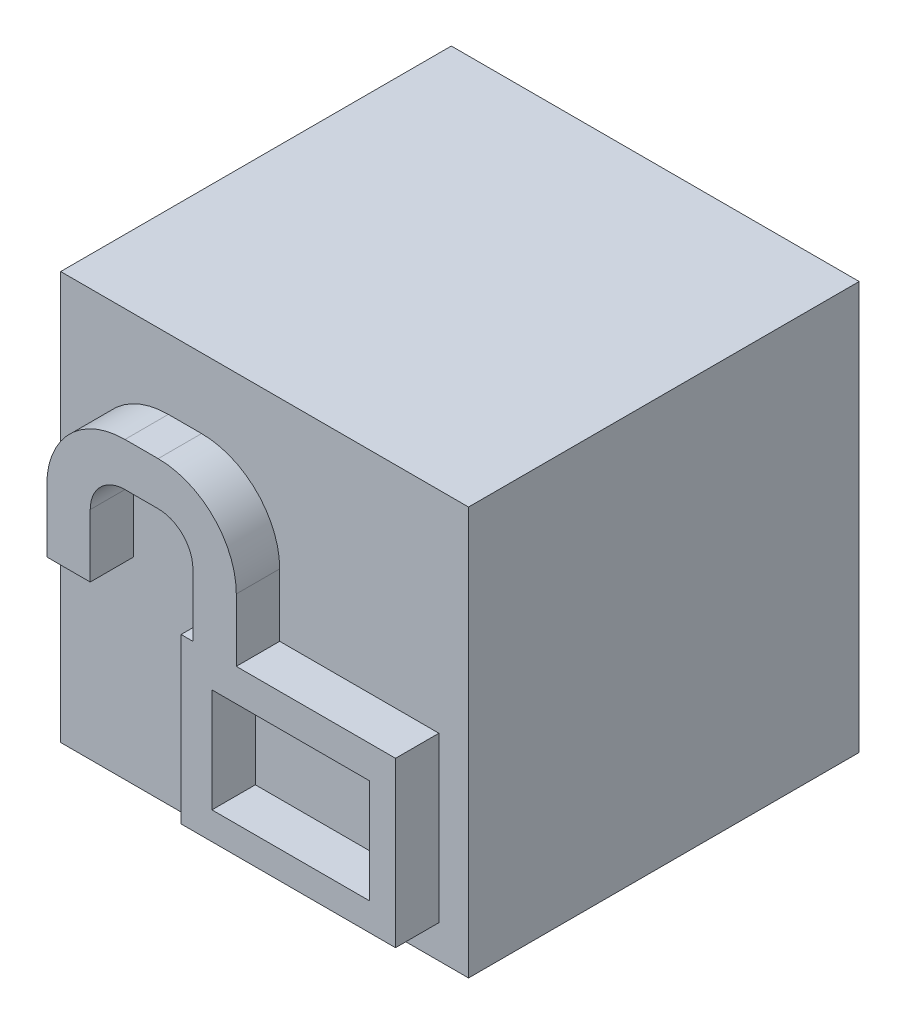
ISO-10303-21;
HEADER;
FILE_DESCRIPTION(('STEP AP214'),'2;1');
FILE_NAME('part.step','',(''),(''),'','','');
FILE_SCHEMA(('AUTOMOTIVE_DESIGN { 1 0 10303 214 1 1 1 1 }'));
ENDSEC;
DATA;
#1=APPLICATION_CONTEXT('core data for automotive mechanical design processes');
#2=APPLICATION_PROTOCOL_DEFINITION('international standard','automotive_design',2000,#1);
#3=PRODUCT_CONTEXT('',#1,'mechanical');
#4=PRODUCT('Part','Part','',(#3));
#5=PRODUCT_RELATED_PRODUCT_CATEGORY('part','',(#4));
#6=PRODUCT_DEFINITION_FORMATION('','',#4);
#7=PRODUCT_DEFINITION_CONTEXT('part definition',#1,'design');
#8=PRODUCT_DEFINITION('design','',#6,#7);
#9=PRODUCT_DEFINITION_SHAPE('','',#8);
#10=(LENGTH_UNIT() NAMED_UNIT(*) SI_UNIT(.MILLI.,.METRE.));
#11=(NAMED_UNIT(*) PLANE_ANGLE_UNIT() SI_UNIT($,.RADIAN.));
#12=(NAMED_UNIT(*) SI_UNIT($,.STERADIAN.) SOLID_ANGLE_UNIT());
#13=UNCERTAINTY_MEASURE_WITH_UNIT(LENGTH_MEASURE(1.E-05),#10,'distance_accuracy_value','');
#14=(GEOMETRIC_REPRESENTATION_CONTEXT(3) GLOBAL_UNCERTAINTY_ASSIGNED_CONTEXT((#13)) GLOBAL_UNIT_ASSIGNED_CONTEXT((#10,
#11,#12)) REPRESENTATION_CONTEXT('',''));
#15=CARTESIAN_POINT('',(0.,0.,0.));
#16=DIRECTION('',(0.,0.,1.));
#17=DIRECTION('',(1.,0.,0.));
#18=AXIS2_PLACEMENT_3D('',#15,#16,#17);
#19=CARTESIAN_POINT('',(0.,0.,-0.300000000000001));
#20=DIRECTION('',(0.,0.,-1.));
#21=DIRECTION('',(-1.,0.,0.));
#22=AXIS2_PLACEMENT_3D('',#19,#20,#21);
#23=PLANE('',#22);
#24=DIRECTION('',(-1.,0.,0.));
#25=VECTOR('',#24,1.);
#26=CARTESIAN_POINT('',(0.30139237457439,25.5354081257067,-0.300000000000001));
#27=LINE('',#26,#25);
#28=CARTESIAN_POINT('',(5.,25.5354081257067,-0.300000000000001));
#29=VERTEX_POINT('',#28);
#30=CARTESIAN_POINT('',(0.30139237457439,25.5354081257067,-0.300000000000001));
#31=VERTEX_POINT('',#30);
#32=EDGE_CURVE('E358',#29,#31,#27,.T.);
#33=ORIENTED_EDGE('',*,*,#32,.T.);
#34=DIRECTION('',(0.,-1.,0.));
#35=VECTOR('',#34,1.);
#36=CARTESIAN_POINT('',(0.30139237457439,25.5354081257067,-0.300000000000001));
#37=LINE('',#36,#35);
#38=CARTESIAN_POINT('',(0.301392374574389,20.836800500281,-0.300000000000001));
#39=VERTEX_POINT('',#38);
#40=EDGE_CURVE('E361',#31,#39,#37,.T.);
#41=ORIENTED_EDGE('',*,*,#40,.T.);
#42=DIRECTION('',(1.,0.,0.));
#43=VECTOR('',#42,1.);
#44=CARTESIAN_POINT('',(0.301392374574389,20.836800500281,-0.300000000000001));
#45=LINE('',#44,#43);
#46=CARTESIAN_POINT('',(5.,20.836800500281,-0.300000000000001));
#47=VERTEX_POINT('',#46);
#48=EDGE_CURVE('E364',#39,#47,#45,.T.);
#49=ORIENTED_EDGE('',*,*,#48,.T.);
#50=DIRECTION('',(0.,1.,0.));
#51=VECTOR('',#50,1.);
#52=CARTESIAN_POINT('',(5.,25.5354081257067,-0.300000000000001));
#53=LINE('',#52,#51);
#54=EDGE_CURVE('E366',#47,#29,#53,.T.);
#55=ORIENTED_EDGE('',*,*,#54,.T.);
#56=EDGE_LOOP('',(#33,#41,#49,#55));
#57=FACE_BOUND('',#56,.T.);
#58=DIRECTION('',(0.,1.,0.));
#59=VECTOR('',#58,1.);
#60=CARTESIAN_POINT('',(4.65854749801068,21.218065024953,-0.300000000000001));
#61=LINE('',#60,#59);
#62=CARTESIAN_POINT('',(4.65854749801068,21.218065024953,-0.300000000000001));
#63=VERTEX_POINT('',#62);
#64=CARTESIAN_POINT('',(4.65854749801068,23.1079682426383,-0.300000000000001));
#65=VERTEX_POINT('',#64);
#66=EDGE_CURVE('E210',#63,#65,#61,.T.);
#67=ORIENTED_EDGE('',*,*,#66,.F.);
#68=DIRECTION('',(1.,0.,0.));
#69=VECTOR('',#68,1.);
#70=CARTESIAN_POINT('',(4.65854749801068,21.218065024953,-0.300000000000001));
#71=LINE('',#70,#69);
#72=CARTESIAN_POINT('',(2.18857497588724,21.218065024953,-0.300000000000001));
#73=VERTEX_POINT('',#72);
#74=EDGE_CURVE('E238',#73,#63,#71,.T.);
#75=ORIENTED_EDGE('',*,*,#74,.F.);
#76=DIRECTION('',(0.,-1.,0.));
#77=VECTOR('',#76,1.);
#78=CARTESIAN_POINT('',(2.18857497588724,21.218065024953,-0.300000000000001));
#79=LINE('',#78,#77);
#80=CARTESIAN_POINT('',(2.18857497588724,23.1079682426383,-0.300000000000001));
#81=VERTEX_POINT('',#80);
#82=EDGE_CURVE('E306',#81,#73,#79,.T.);
#83=ORIENTED_EDGE('',*,*,#82,.F.);
#84=DIRECTION('',(-1.,0.,0.));
#85=VECTOR('',#84,1.);
#86=CARTESIAN_POINT('',(2.32454156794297,23.1079682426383,-0.300000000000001));
#87=LINE('',#86,#85);
#88=CARTESIAN_POINT('',(2.32454156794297,23.1079682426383,-0.300000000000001));
#89=VERTEX_POINT('',#88);
#90=EDGE_CURVE('E303',#89,#81,#87,.T.);
#91=ORIENTED_EDGE('',*,*,#90,.F.);
#92=DIRECTION('',(0.,-1.,0.));
#93=VECTOR('',#92,1.);
#94=CARTESIAN_POINT('',(2.32454156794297,23.1079682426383,-0.300000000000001));
#95=LINE('',#94,#93);
#96=CARTESIAN_POINT('',(2.32454156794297,23.830650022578,-0.300000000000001));
#97=VERTEX_POINT('',#96);
#98=EDGE_CURVE('E300',#97,#89,#95,.T.);
#99=ORIENTED_EDGE('',*,*,#98,.F.);
#100=CARTESIAN_POINT('',(1.92454156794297,23.830650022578,-0.300000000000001));
#101=DIRECTION('',(0.,0.,-1.));
#102=DIRECTION('',(1.,0.,0.));
#103=AXIS2_PLACEMENT_3D('',#100,#101,#102);
#104=CIRCLE('',#103,0.4);
#105=CARTESIAN_POINT('',(1.92454156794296,24.230650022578,-0.300000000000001));
#106=VERTEX_POINT('',#105);
#107=EDGE_CURVE('E297',#106,#97,#104,.T.);
#108=ORIENTED_EDGE('',*,*,#107,.F.);
#109=DIRECTION('',(1.,0.,0.));
#110=VECTOR('',#109,1.);
#111=CARTESIAN_POINT('',(1.92454156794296,24.230650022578,-0.300000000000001));
#112=LINE('',#111,#110);
#113=CARTESIAN_POINT('',(1.54189892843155,24.230650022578,-0.300000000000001));
#114=VERTEX_POINT('',#113);
#115=EDGE_CURVE('E294',#114,#106,#112,.T.);
#116=ORIENTED_EDGE('',*,*,#115,.F.);
#117=CARTESIAN_POINT('',(1.54189892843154,23.830650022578,-0.300000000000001));
#118=DIRECTION('',(0.,0.,-1.));
#119=DIRECTION('',(1.,0.,0.));
#120=AXIS2_PLACEMENT_3D('',#117,#118,#119);
#121=CIRCLE('',#120,0.400000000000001);
#122=CARTESIAN_POINT('',(1.14189892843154,23.830650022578,-0.300000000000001));
#123=VERTEX_POINT('',#122);
#124=EDGE_CURVE('E291',#123,#114,#121,.T.);
#125=ORIENTED_EDGE('',*,*,#124,.F.);
#126=DIRECTION('',(0.,1.,0.));
#127=VECTOR('',#126,1.);
#128=CARTESIAN_POINT('',(1.14189892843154,23.1079682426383,-0.300000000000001));
#129=LINE('',#128,#127);
#130=CARTESIAN_POINT('',(1.14189892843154,23.1079682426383,-0.300000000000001));
#131=VERTEX_POINT('',#130);
#132=EDGE_CURVE('E288',#131,#123,#129,.T.);
#133=ORIENTED_EDGE('',*,*,#132,.F.);
#134=DIRECTION('',(1.,0.,0.));
#135=VECTOR('',#134,1.);
#136=CARTESIAN_POINT('',(1.14189892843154,23.1079682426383,-0.300000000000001));
#137=LINE('',#136,#135);
#138=CARTESIAN_POINT('',(0.641898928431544,23.1079682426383,-0.300000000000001));
#139=VERTEX_POINT('',#138);
#140=EDGE_CURVE('E285',#139,#131,#137,.T.);
#141=ORIENTED_EDGE('',*,*,#140,.F.);
#142=DIRECTION('',(0.,-1.,0.));
#143=VECTOR('',#142,1.);
#144=CARTESIAN_POINT('',(0.641898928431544,23.1079682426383,-0.300000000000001));
#145=LINE('',#144,#143);
#146=CARTESIAN_POINT('',(0.641898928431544,23.830650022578,-0.300000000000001));
#147=VERTEX_POINT('',#146);
#148=EDGE_CURVE('E282',#147,#139,#145,.T.);
#149=ORIENTED_EDGE('',*,*,#148,.F.);
#150=CARTESIAN_POINT('',(1.54189892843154,23.830650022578,-0.300000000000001));
#151=DIRECTION('',(0.,0.,1.));
#152=DIRECTION('',(1.,0.,0.));
#153=AXIS2_PLACEMENT_3D('',#150,#151,#152);
#154=CIRCLE('',#153,0.900000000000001);
#155=CARTESIAN_POINT('',(1.54189892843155,24.730650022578,-0.300000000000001));
#156=VERTEX_POINT('',#155);
#157=EDGE_CURVE('E279',#156,#147,#154,.T.);
#158=ORIENTED_EDGE('',*,*,#157,.F.);
#159=DIRECTION('',(-1.,0.,0.));
#160=VECTOR('',#159,1.);
#161=CARTESIAN_POINT('',(1.92454156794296,24.730650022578,-0.300000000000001));
#162=LINE('',#161,#160);
#163=CARTESIAN_POINT('',(1.92454156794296,24.730650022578,-0.300000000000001));
#164=VERTEX_POINT('',#163);
#165=EDGE_CURVE('E276',#164,#156,#162,.T.);
#166=ORIENTED_EDGE('',*,*,#165,.F.);
#167=CARTESIAN_POINT('',(1.92454156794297,23.830650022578,-0.300000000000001));
#168=DIRECTION('',(0.,0.,1.));
#169=DIRECTION('',(1.,0.,0.));
#170=AXIS2_PLACEMENT_3D('',#167,#168,#169);
#171=CIRCLE('',#170,0.900000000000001);
#172=CARTESIAN_POINT('',(2.82454156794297,23.830650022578,-0.300000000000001));
#173=VERTEX_POINT('',#172);
#174=EDGE_CURVE('E273',#173,#164,#171,.T.);
#175=ORIENTED_EDGE('',*,*,#174,.F.);
#176=DIRECTION('',(0.,1.,0.));
#177=VECTOR('',#176,1.);
#178=CARTESIAN_POINT('',(2.82454156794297,23.1079682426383,-0.300000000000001));
#179=LINE('',#178,#177);
#180=CARTESIAN_POINT('',(2.82454156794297,23.1079682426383,-0.300000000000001));
#181=VERTEX_POINT('',#180);
#182=EDGE_CURVE('E52',#181,#173,#179,.T.);
#183=ORIENTED_EDGE('',*,*,#182,.F.);
#184=DIRECTION('',(-1.,0.,0.));
#185=VECTOR('',#184,1.);
#186=CARTESIAN_POINT('',(4.65854749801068,23.1079682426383,-0.300000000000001));
#187=LINE('',#186,#185);
#188=EDGE_CURVE('E47',#65,#181,#187,.T.);
#189=ORIENTED_EDGE('',*,*,#188,.F.);
#190=EDGE_LOOP('',(#67,#75,#83,#91,#99,#108,#116,#125,#133,#141,#149,#158,#166,#175,#183,#189));
#191=FACE_BOUND('',#190,.T.);
#192=ADVANCED_FACE('F32',(#57,#191),#23,.F.);
#193=CARTESIAN_POINT('',(0.30139237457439,25.5354081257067,-0.300000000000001));
#194=DIRECTION('',(0.,-1.,0.));
#195=DIRECTION('',(0.,0.,-1.));
#196=AXIS2_PLACEMENT_3D('',#193,#194,#195);
#197=PLANE('',#196);
#198=DIRECTION('',(-1.,0.,0.));
#199=VECTOR('',#198,1.);
#200=CARTESIAN_POINT('',(0.30139237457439,25.5354081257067,-4.8));
#201=LINE('',#200,#199);
#202=CARTESIAN_POINT('',(5.,25.5354081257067,-4.8));
#203=VERTEX_POINT('',#202);
#204=CARTESIAN_POINT('',(0.30139237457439,25.5354081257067,-4.8));
#205=VERTEX_POINT('',#204);
#206=EDGE_CURVE('E357',#203,#205,#201,.T.);
#207=ORIENTED_EDGE('',*,*,#206,.T.);
#208=DIRECTION('',(0.,0.,-1.));
#209=VECTOR('',#208,1.);
#210=CARTESIAN_POINT('',(0.30139237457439,25.5354081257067,-0.300000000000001));
#211=LINE('',#210,#209);
#212=EDGE_CURVE('E11',#31,#205,#211,.T.);
#213=ORIENTED_EDGE('',*,*,#212,.F.);
#214=ORIENTED_EDGE('',*,*,#32,.F.);
#215=DIRECTION('',(0.,0.,-1.));
#216=VECTOR('',#215,1.);
#217=CARTESIAN_POINT('',(5.,25.5354081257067,-0.300000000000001));
#218=LINE('',#217,#216);
#219=EDGE_CURVE('E368',#29,#203,#218,.T.);
#220=ORIENTED_EDGE('',*,*,#219,.T.);
#221=EDGE_LOOP('',(#207,#213,#214,#220));
#222=FACE_BOUND('',#221,.T.);
#223=ADVANCED_FACE('F34',(#222),#197,.F.);
#224=CARTESIAN_POINT('',(0.30139237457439,25.5354081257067,-0.300000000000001));
#225=DIRECTION('',(1.,0.,0.));
#226=DIRECTION('',(0.,1.,0.));
#227=AXIS2_PLACEMENT_3D('',#224,#225,#226);
#228=PLANE('',#227);
#229=DIRECTION('',(0.,-1.,0.));
#230=VECTOR('',#229,1.);
#231=CARTESIAN_POINT('',(0.30139237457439,25.5354081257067,-4.8));
#232=LINE('',#231,#230);
#233=CARTESIAN_POINT('',(0.301392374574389,20.836800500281,-4.8));
#234=VERTEX_POINT('',#233);
#235=EDGE_CURVE('E371',#205,#234,#232,.T.);
#236=ORIENTED_EDGE('',*,*,#235,.T.);
#237=DIRECTION('',(0.,0.,-1.));
#238=VECTOR('',#237,1.);
#239=CARTESIAN_POINT('',(0.301392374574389,20.836800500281,-0.300000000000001));
#240=LINE('',#239,#238);
#241=EDGE_CURVE('E40',#39,#234,#240,.T.);
#242=ORIENTED_EDGE('',*,*,#241,.F.);
#243=ORIENTED_EDGE('',*,*,#40,.F.);
#244=ORIENTED_EDGE('',*,*,#212,.T.);
#245=EDGE_LOOP('',(#236,#242,#243,#244));
#246=FACE_BOUND('',#245,.T.);
#247=ADVANCED_FACE('F400',(#246),#228,.F.);
#248=CARTESIAN_POINT('',(0.301392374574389,20.836800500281,-0.300000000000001));
#249=DIRECTION('',(0.,1.,0.));
#250=DIRECTION('',(0.,0.,1.));
#251=AXIS2_PLACEMENT_3D('',#248,#249,#250);
#252=PLANE('',#251);
#253=DIRECTION('',(1.,0.,0.));
#254=VECTOR('',#253,1.);
#255=CARTESIAN_POINT('',(0.301392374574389,20.836800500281,-4.8));
#256=LINE('',#255,#254);
#257=CARTESIAN_POINT('',(5.,20.836800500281,-4.8));
#258=VERTEX_POINT('',#257);
#259=EDGE_CURVE('E373',#234,#258,#256,.T.);
#260=ORIENTED_EDGE('',*,*,#259,.T.);
#261=DIRECTION('',(0.,0.,-1.));
#262=VECTOR('',#261,1.);
#263=CARTESIAN_POINT('',(5.,20.836800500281,-0.300000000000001));
#264=LINE('',#263,#262);
#265=EDGE_CURVE('E378',#47,#258,#264,.T.);
#266=ORIENTED_EDGE('',*,*,#265,.F.);
#267=ORIENTED_EDGE('',*,*,#48,.F.);
#268=ORIENTED_EDGE('',*,*,#241,.T.);
#269=EDGE_LOOP('',(#260,#266,#267,#268));
#270=FACE_BOUND('',#269,.T.);
#271=ADVANCED_FACE('F385',(#270),#252,.F.);
#272=CARTESIAN_POINT('',(5.,25.5354081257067,-0.300000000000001));
#273=DIRECTION('',(-1.,0.,0.));
#274=DIRECTION('',(0.,-1.,0.));
#275=AXIS2_PLACEMENT_3D('',#272,#273,#274);
#276=PLANE('',#275);
#277=DIRECTION('',(0.,1.,0.));
#278=VECTOR('',#277,1.);
#279=CARTESIAN_POINT('',(5.,25.5354081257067,-4.8));
#280=LINE('',#279,#278);
#281=EDGE_CURVE('E362',#258,#203,#280,.T.);
#282=ORIENTED_EDGE('',*,*,#281,.T.);
#283=ORIENTED_EDGE('',*,*,#219,.F.);
#284=ORIENTED_EDGE('',*,*,#54,.F.);
#285=ORIENTED_EDGE('',*,*,#265,.T.);
#286=EDGE_LOOP('',(#282,#283,#284,#285));
#287=FACE_BOUND('',#286,.T.);
#288=ADVANCED_FACE('F394',(#287),#276,.F.);
#289=CARTESIAN_POINT('',(0.,0.,-4.8));
#290=DIRECTION('',(0.,0.,-1.));
#291=DIRECTION('',(-1.,0.,0.));
#292=AXIS2_PLACEMENT_3D('',#289,#290,#291);
#293=PLANE('',#292);
#294=ORIENTED_EDGE('',*,*,#206,.F.);
#295=ORIENTED_EDGE('',*,*,#281,.F.);
#296=ORIENTED_EDGE('',*,*,#259,.F.);
#297=ORIENTED_EDGE('',*,*,#235,.F.);
#298=EDGE_LOOP('',(#294,#295,#296,#297));
#299=FACE_BOUND('',#298,.T.);
#300=ADVANCED_FACE('F391',(#299),#293,.T.);
#301=CARTESIAN_POINT('',(1.92454156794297,23.830650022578,0.199999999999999));
#302=DIRECTION('',(0.,0.,1.));
#303=DIRECTION('',(1.,0.,0.));
#304=AXIS2_PLACEMENT_3D('',#301,#302,#303);
#305=PLANE('',#304);
#306=DIRECTION('',(0.,1.,0.));
#307=VECTOR('',#306,1.);
#308=CARTESIAN_POINT('',(4.65854749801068,21.218065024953,0.199999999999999));
#309=LINE('',#308,#307);
#310=CARTESIAN_POINT('',(4.65854749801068,21.218065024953,0.199999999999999));
#311=VERTEX_POINT('',#310);
#312=CARTESIAN_POINT('',(4.65854749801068,23.1079682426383,0.199999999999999));
#313=VERTEX_POINT('',#312);
#314=EDGE_CURVE('E234',#311,#313,#309,.T.);
#315=ORIENTED_EDGE('',*,*,#314,.T.);
#316=DIRECTION('',(-1.,0.,0.));
#317=VECTOR('',#316,1.);
#318=CARTESIAN_POINT('',(4.65854749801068,23.1079682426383,0.199999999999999));
#319=LINE('',#318,#317);
#320=CARTESIAN_POINT('',(2.82454156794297,23.1079682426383,0.199999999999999));
#321=VERTEX_POINT('',#320);
#322=EDGE_CURVE('E237',#313,#321,#319,.T.);
#323=ORIENTED_EDGE('',*,*,#322,.T.);
#324=DIRECTION('',(0.,1.,0.));
#325=VECTOR('',#324,1.);
#326=CARTESIAN_POINT('',(2.82454156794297,23.1079682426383,0.199999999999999));
#327=LINE('',#326,#325);
#328=CARTESIAN_POINT('',(2.82454156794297,23.830650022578,0.199999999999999));
#329=VERTEX_POINT('',#328);
#330=EDGE_CURVE('E240',#321,#329,#327,.T.);
#331=ORIENTED_EDGE('',*,*,#330,.T.);
#332=CARTESIAN_POINT('',(1.92454156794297,23.830650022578,0.199999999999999));
#333=DIRECTION('',(0.,0.,1.));
#334=DIRECTION('',(1.,0.,0.));
#335=AXIS2_PLACEMENT_3D('',#332,#333,#334);
#336=CIRCLE('',#335,0.900000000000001);
#337=CARTESIAN_POINT('',(1.92454156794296,24.730650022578,0.199999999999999));
#338=VERTEX_POINT('',#337);
#339=EDGE_CURVE('E242',#329,#338,#336,.T.);
#340=ORIENTED_EDGE('',*,*,#339,.T.);
#341=DIRECTION('',(-1.,0.,0.));
#342=VECTOR('',#341,1.);
#343=CARTESIAN_POINT('',(1.92454156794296,24.730650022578,0.199999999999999));
#344=LINE('',#343,#342);
#345=CARTESIAN_POINT('',(1.54189892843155,24.730650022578,0.199999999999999));
#346=VERTEX_POINT('',#345);
#347=EDGE_CURVE('E244',#338,#346,#344,.T.);
#348=ORIENTED_EDGE('',*,*,#347,.T.);
#349=CARTESIAN_POINT('',(1.54189892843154,23.830650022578,0.199999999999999));
#350=DIRECTION('',(0.,0.,1.));
#351=DIRECTION('',(1.,0.,0.));
#352=AXIS2_PLACEMENT_3D('',#349,#350,#351);
#353=CIRCLE('',#352,0.900000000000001);
#354=CARTESIAN_POINT('',(0.641898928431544,23.830650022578,0.199999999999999));
#355=VERTEX_POINT('',#354);
#356=EDGE_CURVE('E246',#346,#355,#353,.T.);
#357=ORIENTED_EDGE('',*,*,#356,.T.);
#358=DIRECTION('',(0.,-1.,0.));
#359=VECTOR('',#358,1.);
#360=CARTESIAN_POINT('',(0.641898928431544,23.1079682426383,0.199999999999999));
#361=LINE('',#360,#359);
#362=CARTESIAN_POINT('',(0.641898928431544,23.1079682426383,0.199999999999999));
#363=VERTEX_POINT('',#362);
#364=EDGE_CURVE('E248',#355,#363,#361,.T.);
#365=ORIENTED_EDGE('',*,*,#364,.T.);
#366=DIRECTION('',(1.,0.,0.));
#367=VECTOR('',#366,1.);
#368=CARTESIAN_POINT('',(1.14189892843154,23.1079682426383,0.199999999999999));
#369=LINE('',#368,#367);
#370=CARTESIAN_POINT('',(1.14189892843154,23.1079682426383,0.199999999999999));
#371=VERTEX_POINT('',#370);
#372=EDGE_CURVE('E250',#363,#371,#369,.T.);
#373=ORIENTED_EDGE('',*,*,#372,.T.);
#374=DIRECTION('',(0.,1.,0.));
#375=VECTOR('',#374,1.);
#376=CARTESIAN_POINT('',(1.14189892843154,23.1079682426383,0.199999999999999));
#377=LINE('',#376,#375);
#378=CARTESIAN_POINT('',(1.14189892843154,23.830650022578,0.199999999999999));
#379=VERTEX_POINT('',#378);
#380=EDGE_CURVE('E252',#371,#379,#377,.T.);
#381=ORIENTED_EDGE('',*,*,#380,.T.);
#382=CARTESIAN_POINT('',(1.54189892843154,23.830650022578,0.199999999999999));
#383=DIRECTION('',(0.,0.,-1.));
#384=DIRECTION('',(1.,0.,0.));
#385=AXIS2_PLACEMENT_3D('',#382,#383,#384);
#386=CIRCLE('',#385,0.400000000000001);
#387=CARTESIAN_POINT('',(1.54189892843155,24.230650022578,0.199999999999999));
#388=VERTEX_POINT('',#387);
#389=EDGE_CURVE('E254',#379,#388,#386,.T.);
#390=ORIENTED_EDGE('',*,*,#389,.T.);
#391=DIRECTION('',(1.,0.,0.));
#392=VECTOR('',#391,1.);
#393=CARTESIAN_POINT('',(1.92454156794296,24.230650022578,0.199999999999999));
#394=LINE('',#393,#392);
#395=CARTESIAN_POINT('',(1.92454156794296,24.230650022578,0.199999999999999));
#396=VERTEX_POINT('',#395);
#397=EDGE_CURVE('E256',#388,#396,#394,.T.);
#398=ORIENTED_EDGE('',*,*,#397,.T.);
#399=CARTESIAN_POINT('',(1.92454156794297,23.830650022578,0.199999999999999));
#400=DIRECTION('',(0.,0.,-1.));
#401=DIRECTION('',(1.,0.,0.));
#402=AXIS2_PLACEMENT_3D('',#399,#400,#401);
#403=CIRCLE('',#402,0.4);
#404=CARTESIAN_POINT('',(2.32454156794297,23.830650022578,0.199999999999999));
#405=VERTEX_POINT('',#404);
#406=EDGE_CURVE('E258',#396,#405,#403,.T.);
#407=ORIENTED_EDGE('',*,*,#406,.T.);
#408=DIRECTION('',(0.,-1.,0.));
#409=VECTOR('',#408,1.);
#410=CARTESIAN_POINT('',(2.32454156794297,23.1079682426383,0.199999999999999));
#411=LINE('',#410,#409);
#412=CARTESIAN_POINT('',(2.32454156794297,23.1079682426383,0.199999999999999));
#413=VERTEX_POINT('',#412);
#414=EDGE_CURVE('E260',#405,#413,#411,.T.);
#415=ORIENTED_EDGE('',*,*,#414,.T.);
#416=DIRECTION('',(-1.,0.,0.));
#417=VECTOR('',#416,1.);
#418=CARTESIAN_POINT('',(2.32454156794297,23.1079682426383,0.199999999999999));
#419=LINE('',#418,#417);
#420=CARTESIAN_POINT('',(2.18857497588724,23.1079682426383,0.199999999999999));
#421=VERTEX_POINT('',#420);
#422=EDGE_CURVE('E262',#413,#421,#419,.T.);
#423=ORIENTED_EDGE('',*,*,#422,.T.);
#424=DIRECTION('',(0.,-1.,0.));
#425=VECTOR('',#424,1.);
#426=CARTESIAN_POINT('',(2.18857497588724,21.218065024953,0.199999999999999));
#427=LINE('',#426,#425);
#428=CARTESIAN_POINT('',(2.18857497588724,21.218065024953,0.199999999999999));
#429=VERTEX_POINT('',#428);
#430=EDGE_CURVE('E264',#421,#429,#427,.T.);
#431=ORIENTED_EDGE('',*,*,#430,.T.);
#432=DIRECTION('',(1.,0.,0.));
#433=VECTOR('',#432,1.);
#434=CARTESIAN_POINT('',(4.65854749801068,21.218065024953,0.199999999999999));
#435=LINE('',#434,#433);
#436=EDGE_CURVE('E266',#429,#311,#435,.T.);
#437=ORIENTED_EDGE('',*,*,#436,.T.);
#438=EDGE_LOOP('',(#315,#323,#331,#340,#348,#357,#365,#373,#381,#390,#398,#407,#415,#423,#431,#437));
#439=FACE_BOUND('',#438,.T.);
#440=DIRECTION('',(-1.,0.,0.));
#441=VECTOR('',#440,1.);
#442=CARTESIAN_POINT('',(4.35915688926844,22.7337299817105,0.199999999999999));
#443=LINE('',#442,#441);
#444=CARTESIAN_POINT('',(4.35915688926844,22.7337299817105,0.199999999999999));
#445=VERTEX_POINT('',#444);
#446=CARTESIAN_POINT('',(2.54410132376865,22.7337299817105,0.199999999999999));
#447=VERTEX_POINT('',#446);
#448=EDGE_CURVE('E202',#445,#447,#443,.T.);
#449=ORIENTED_EDGE('',*,*,#448,.F.);
#450=DIRECTION('',(0.,1.,0.));
#451=VECTOR('',#450,1.);
#452=CARTESIAN_POINT('',(4.35915688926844,21.5361675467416,0.199999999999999));
#453=LINE('',#452,#451);
#454=CARTESIAN_POINT('',(4.35915688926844,21.5361675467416,0.199999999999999));
#455=VERTEX_POINT('',#454);
#456=EDGE_CURVE('E192',#455,#445,#453,.T.);
#457=ORIENTED_EDGE('',*,*,#456,.F.);
#458=DIRECTION('',(1.,0.,0.));
#459=VECTOR('',#458,1.);
#460=CARTESIAN_POINT('',(4.35915688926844,21.5361675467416,0.199999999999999));
#461=LINE('',#460,#459);
#462=CARTESIAN_POINT('',(2.54410132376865,21.5361675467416,0.199999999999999));
#463=VERTEX_POINT('',#462);
#464=EDGE_CURVE('E218',#463,#455,#461,.T.);
#465=ORIENTED_EDGE('',*,*,#464,.F.);
#466=DIRECTION('',(0.,-1.,0.));
#467=VECTOR('',#466,1.);
#468=CARTESIAN_POINT('',(2.54410132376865,21.5361675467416,0.199999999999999));
#469=LINE('',#468,#467);
#470=EDGE_CURVE('E216',#447,#463,#469,.T.);
#471=ORIENTED_EDGE('',*,*,#470,.F.);
#472=EDGE_LOOP('',(#449,#457,#465,#471));
#473=FACE_BOUND('',#472,.T.);
#474=ADVANCED_FACE('F214',(#439,#473),#305,.T.);
#475=CARTESIAN_POINT('',(4.65854749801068,21.218065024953,0.199999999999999));
#476=DIRECTION('',(-1.,0.,0.));
#477=DIRECTION('',(0.,0.,1.));
#478=AXIS2_PLACEMENT_3D('',#475,#476,#477);
#479=PLANE('',#478);
#480=ORIENTED_EDGE('',*,*,#66,.T.);
#481=DIRECTION('',(0.,0.,-1.));
#482=VECTOR('',#481,1.);
#483=CARTESIAN_POINT('',(4.65854749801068,23.1079682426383,0.199999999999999));
#484=LINE('',#483,#482);
#485=EDGE_CURVE('E355',#313,#65,#484,.T.);
#486=ORIENTED_EDGE('',*,*,#485,.F.);
#487=ORIENTED_EDGE('',*,*,#314,.F.);
#488=DIRECTION('',(0.,0.,-1.));
#489=VECTOR('',#488,1.);
#490=CARTESIAN_POINT('',(4.65854749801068,21.218065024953,0.199999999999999));
#491=LINE('',#490,#489);
#492=EDGE_CURVE('E268',#311,#63,#491,.T.);
#493=ORIENTED_EDGE('',*,*,#492,.T.);
#494=EDGE_LOOP('',(#480,#486,#487,#493));
#495=FACE_BOUND('',#494,.T.);
#496=ADVANCED_FACE('F438',(#495),#479,.F.);
#497=CARTESIAN_POINT('',(4.65854749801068,23.1079682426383,0.199999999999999));
#498=DIRECTION('',(0.,-1.,0.));
#499=DIRECTION('',(0.,0.,-1.));
#500=AXIS2_PLACEMENT_3D('',#497,#498,#499);
#501=PLANE('',#500);
#502=ORIENTED_EDGE('',*,*,#188,.T.);
#503=DIRECTION('',(0.,0.,-1.));
#504=VECTOR('',#503,1.);
#505=CARTESIAN_POINT('',(2.82454156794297,23.1079682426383,0.199999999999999));
#506=LINE('',#505,#504);
#507=EDGE_CURVE('E352',#321,#181,#506,.T.);
#508=ORIENTED_EDGE('',*,*,#507,.F.);
#509=ORIENTED_EDGE('',*,*,#322,.F.);
#510=ORIENTED_EDGE('',*,*,#485,.T.);
#511=EDGE_LOOP('',(#502,#508,#509,#510));
#512=FACE_BOUND('',#511,.T.);
#513=ADVANCED_FACE('F494',(#512),#501,.F.);
#514=CARTESIAN_POINT('',(2.82454156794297,23.1079682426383,0.199999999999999));
#515=DIRECTION('',(-1.,0.,0.));
#516=DIRECTION('',(0.,0.,1.));
#517=AXIS2_PLACEMENT_3D('',#514,#515,#516);
#518=PLANE('',#517);
#519=ORIENTED_EDGE('',*,*,#182,.T.);
#520=DIRECTION('',(0.,0.,-1.));
#521=VECTOR('',#520,1.);
#522=CARTESIAN_POINT('',(2.82454156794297,23.830650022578,0.199999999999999));
#523=LINE('',#522,#521);
#524=EDGE_CURVE('E349',#329,#173,#523,.T.);
#525=ORIENTED_EDGE('',*,*,#524,.F.);
#526=ORIENTED_EDGE('',*,*,#330,.F.);
#527=ORIENTED_EDGE('',*,*,#507,.T.);
#528=EDGE_LOOP('',(#519,#525,#526,#527));
#529=FACE_BOUND('',#528,.T.);
#530=ADVANCED_FACE('F490',(#529),#518,.F.);
#531=CARTESIAN_POINT('',(1.92454156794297,23.830650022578,0.199999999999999));
#532=DIRECTION('',(0.,0.,-1.));
#533=DIRECTION('',(-1.,0.,0.));
#534=AXIS2_PLACEMENT_3D('',#531,#532,#533);
#535=CYLINDRICAL_SURFACE('',#534,0.900000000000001);
#536=ORIENTED_EDGE('',*,*,#174,.T.);
#537=DIRECTION('',(0.,0.,-1.));
#538=VECTOR('',#537,1.);
#539=CARTESIAN_POINT('',(1.92454156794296,24.730650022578,0.199999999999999));
#540=LINE('',#539,#538);
#541=EDGE_CURVE('E346',#338,#164,#540,.T.);
#542=ORIENTED_EDGE('',*,*,#541,.F.);
#543=ORIENTED_EDGE('',*,*,#339,.F.);
#544=ORIENTED_EDGE('',*,*,#524,.T.);
#545=EDGE_LOOP('',(#536,#542,#543,#544));
#546=FACE_BOUND('',#545,.T.);
#547=ADVANCED_FACE('F486',(#546),#535,.T.);
#548=CARTESIAN_POINT('',(1.92454156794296,24.730650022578,0.199999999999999));
#549=DIRECTION('',(0.,-1.,0.));
#550=DIRECTION('',(0.,0.,-1.));
#551=AXIS2_PLACEMENT_3D('',#548,#549,#550);
#552=PLANE('',#551);
#553=ORIENTED_EDGE('',*,*,#165,.T.);
#554=DIRECTION('',(0.,0.,-1.));
#555=VECTOR('',#554,1.);
#556=CARTESIAN_POINT('',(1.54189892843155,24.730650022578,0.199999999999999));
#557=LINE('',#556,#555);
#558=EDGE_CURVE('E343',#346,#156,#557,.T.);
#559=ORIENTED_EDGE('',*,*,#558,.F.);
#560=ORIENTED_EDGE('',*,*,#347,.F.);
#561=ORIENTED_EDGE('',*,*,#541,.T.);
#562=EDGE_LOOP('',(#553,#559,#560,#561));
#563=FACE_BOUND('',#562,.T.);
#564=ADVANCED_FACE('F482',(#563),#552,.F.);
#565=CARTESIAN_POINT('',(1.54189892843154,23.830650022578,0.199999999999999));
#566=DIRECTION('',(0.,0.,-1.));
#567=DIRECTION('',(-1.,0.,0.));
#568=AXIS2_PLACEMENT_3D('',#565,#566,#567);
#569=CYLINDRICAL_SURFACE('',#568,0.900000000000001);
#570=ORIENTED_EDGE('',*,*,#157,.T.);
#571=DIRECTION('',(0.,0.,-1.));
#572=VECTOR('',#571,1.);
#573=CARTESIAN_POINT('',(0.641898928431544,23.830650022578,0.199999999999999));
#574=LINE('',#573,#572);
#575=EDGE_CURVE('E340',#355,#147,#574,.T.);
#576=ORIENTED_EDGE('',*,*,#575,.F.);
#577=ORIENTED_EDGE('',*,*,#356,.F.);
#578=ORIENTED_EDGE('',*,*,#558,.T.);
#579=EDGE_LOOP('',(#570,#576,#577,#578));
#580=FACE_BOUND('',#579,.T.);
#581=ADVANCED_FACE('F478',(#580),#569,.T.);
#582=CARTESIAN_POINT('',(0.641898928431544,23.1079682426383,0.199999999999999));
#583=DIRECTION('',(1.,0.,0.));
#584=DIRECTION('',(0.,0.,-1.));
#585=AXIS2_PLACEMENT_3D('',#582,#583,#584);
#586=PLANE('',#585);
#587=ORIENTED_EDGE('',*,*,#148,.T.);
#588=DIRECTION('',(0.,0.,-1.));
#589=VECTOR('',#588,1.);
#590=CARTESIAN_POINT('',(0.641898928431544,23.1079682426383,0.199999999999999));
#591=LINE('',#590,#589);
#592=EDGE_CURVE('E337',#363,#139,#591,.T.);
#593=ORIENTED_EDGE('',*,*,#592,.F.);
#594=ORIENTED_EDGE('',*,*,#364,.F.);
#595=ORIENTED_EDGE('',*,*,#575,.T.);
#596=EDGE_LOOP('',(#587,#593,#594,#595));
#597=FACE_BOUND('',#596,.T.);
#598=ADVANCED_FACE('F474',(#597),#586,.F.);
#599=CARTESIAN_POINT('',(1.14189892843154,23.1079682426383,0.199999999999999));
#600=DIRECTION('',(0.,1.,0.));
#601=DIRECTION('',(0.,0.,1.));
#602=AXIS2_PLACEMENT_3D('',#599,#600,#601);
#603=PLANE('',#602);
#604=ORIENTED_EDGE('',*,*,#140,.T.);
#605=DIRECTION('',(0.,0.,-1.));
#606=VECTOR('',#605,1.);
#607=CARTESIAN_POINT('',(1.14189892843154,23.1079682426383,0.199999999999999));
#608=LINE('',#607,#606);
#609=EDGE_CURVE('E334',#371,#131,#608,.T.);
#610=ORIENTED_EDGE('',*,*,#609,.F.);
#611=ORIENTED_EDGE('',*,*,#372,.F.);
#612=ORIENTED_EDGE('',*,*,#592,.T.);
#613=EDGE_LOOP('',(#604,#610,#611,#612));
#614=FACE_BOUND('',#613,.T.);
#615=ADVANCED_FACE('F470',(#614),#603,.F.);
#616=CARTESIAN_POINT('',(1.14189892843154,23.1079682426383,0.199999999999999));
#617=DIRECTION('',(-1.,0.,0.));
#618=DIRECTION('',(0.,-1.,0.));
#619=AXIS2_PLACEMENT_3D('',#616,#617,#618);
#620=PLANE('',#619);
#621=ORIENTED_EDGE('',*,*,#132,.T.);
#622=DIRECTION('',(0.,0.,-1.));
#623=VECTOR('',#622,1.);
#624=CARTESIAN_POINT('',(1.14189892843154,23.830650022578,0.199999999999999));
#625=LINE('',#624,#623);
#626=EDGE_CURVE('E331',#379,#123,#625,.T.);
#627=ORIENTED_EDGE('',*,*,#626,.F.);
#628=ORIENTED_EDGE('',*,*,#380,.F.);
#629=ORIENTED_EDGE('',*,*,#609,.T.);
#630=EDGE_LOOP('',(#621,#627,#628,#629));
#631=FACE_BOUND('',#630,.T.);
#632=ADVANCED_FACE('F466',(#631),#620,.F.);
#633=CARTESIAN_POINT('',(1.54189892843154,23.830650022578,0.199999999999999));
#634=DIRECTION('',(0.,0.,-1.));
#635=DIRECTION('',(-1.,0.,0.));
#636=AXIS2_PLACEMENT_3D('',#633,#634,#635);
#637=CYLINDRICAL_SURFACE('',#636,0.400000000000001);
#638=ORIENTED_EDGE('',*,*,#124,.T.);
#639=DIRECTION('',(0.,0.,-1.));
#640=VECTOR('',#639,1.);
#641=CARTESIAN_POINT('',(1.54189892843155,24.230650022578,0.199999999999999));
#642=LINE('',#641,#640);
#643=EDGE_CURVE('E328',#388,#114,#642,.T.);
#644=ORIENTED_EDGE('',*,*,#643,.F.);
#645=ORIENTED_EDGE('',*,*,#389,.F.);
#646=ORIENTED_EDGE('',*,*,#626,.T.);
#647=EDGE_LOOP('',(#638,#644,#645,#646));
#648=FACE_BOUND('',#647,.T.);
#649=ADVANCED_FACE('F462',(#648),#637,.F.);
#650=CARTESIAN_POINT('',(1.92454156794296,24.230650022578,0.199999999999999));
#651=DIRECTION('',(0.,1.,0.));
#652=DIRECTION('',(0.,0.,1.));
#653=AXIS2_PLACEMENT_3D('',#650,#651,#652);
#654=PLANE('',#653);
#655=ORIENTED_EDGE('',*,*,#115,.T.);
#656=DIRECTION('',(0.,0.,-1.));
#657=VECTOR('',#656,1.);
#658=CARTESIAN_POINT('',(1.92454156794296,24.230650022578,0.199999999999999));
#659=LINE('',#658,#657);
#660=EDGE_CURVE('E325',#396,#106,#659,.T.);
#661=ORIENTED_EDGE('',*,*,#660,.F.);
#662=ORIENTED_EDGE('',*,*,#397,.F.);
#663=ORIENTED_EDGE('',*,*,#643,.T.);
#664=EDGE_LOOP('',(#655,#661,#662,#663));
#665=FACE_BOUND('',#664,.T.);
#666=ADVANCED_FACE('F458',(#665),#654,.F.);
#667=CARTESIAN_POINT('',(1.92454156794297,23.830650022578,0.199999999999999));
#668=DIRECTION('',(0.,0.,-1.));
#669=DIRECTION('',(-1.,0.,0.));
#670=AXIS2_PLACEMENT_3D('',#667,#668,#669);
#671=CYLINDRICAL_SURFACE('',#670,0.4);
#672=ORIENTED_EDGE('',*,*,#107,.T.);
#673=DIRECTION('',(0.,0.,-1.));
#674=VECTOR('',#673,1.);
#675=CARTESIAN_POINT('',(2.32454156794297,23.830650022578,0.199999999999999));
#676=LINE('',#675,#674);
#677=EDGE_CURVE('E322',#405,#97,#676,.T.);
#678=ORIENTED_EDGE('',*,*,#677,.F.);
#679=ORIENTED_EDGE('',*,*,#406,.F.);
#680=ORIENTED_EDGE('',*,*,#660,.T.);
#681=EDGE_LOOP('',(#672,#678,#679,#680));
#682=FACE_BOUND('',#681,.T.);
#683=ADVANCED_FACE('F454',(#682),#671,.F.);
#684=CARTESIAN_POINT('',(2.32454156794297,23.1079682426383,0.199999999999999));
#685=DIRECTION('',(1.,0.,0.));
#686=DIRECTION('',(0.,0.,-1.));
#687=AXIS2_PLACEMENT_3D('',#684,#685,#686);
#688=PLANE('',#687);
#689=ORIENTED_EDGE('',*,*,#98,.T.);
#690=DIRECTION('',(0.,0.,-1.));
#691=VECTOR('',#690,1.);
#692=CARTESIAN_POINT('',(2.32454156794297,23.1079682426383,0.199999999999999));
#693=LINE('',#692,#691);
#694=EDGE_CURVE('E319',#413,#89,#693,.T.);
#695=ORIENTED_EDGE('',*,*,#694,.F.);
#696=ORIENTED_EDGE('',*,*,#414,.F.);
#697=ORIENTED_EDGE('',*,*,#677,.T.);
#698=EDGE_LOOP('',(#689,#695,#696,#697));
#699=FACE_BOUND('',#698,.T.);
#700=ADVANCED_FACE('F450',(#699),#688,.F.);
#701=CARTESIAN_POINT('',(2.32454156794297,23.1079682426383,0.199999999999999));
#702=DIRECTION('',(0.,-1.,0.));
#703=DIRECTION('',(0.,0.,-1.));
#704=AXIS2_PLACEMENT_3D('',#701,#702,#703);
#705=PLANE('',#704);
#706=ORIENTED_EDGE('',*,*,#90,.T.);
#707=DIRECTION('',(0.,0.,-1.));
#708=VECTOR('',#707,1.);
#709=CARTESIAN_POINT('',(2.18857497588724,23.1079682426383,0.199999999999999));
#710=LINE('',#709,#708);
#711=EDGE_CURVE('E316',#421,#81,#710,.T.);
#712=ORIENTED_EDGE('',*,*,#711,.F.);
#713=ORIENTED_EDGE('',*,*,#422,.F.);
#714=ORIENTED_EDGE('',*,*,#694,.T.);
#715=EDGE_LOOP('',(#706,#712,#713,#714));
#716=FACE_BOUND('',#715,.T.);
#717=ADVANCED_FACE('F446',(#716),#705,.F.);
#718=CARTESIAN_POINT('',(2.18857497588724,21.218065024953,0.199999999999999));
#719=DIRECTION('',(1.,0.,0.));
#720=DIRECTION('',(0.,0.,-1.));
#721=AXIS2_PLACEMENT_3D('',#718,#719,#720);
#722=PLANE('',#721);
#723=ORIENTED_EDGE('',*,*,#82,.T.);
#724=DIRECTION('',(0.,0.,-1.));
#725=VECTOR('',#724,1.);
#726=CARTESIAN_POINT('',(2.18857497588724,21.218065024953,0.199999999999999));
#727=LINE('',#726,#725);
#728=EDGE_CURVE('E313',#429,#73,#727,.T.);
#729=ORIENTED_EDGE('',*,*,#728,.F.);
#730=ORIENTED_EDGE('',*,*,#430,.F.);
#731=ORIENTED_EDGE('',*,*,#711,.T.);
#732=EDGE_LOOP('',(#723,#729,#730,#731));
#733=FACE_BOUND('',#732,.T.);
#734=ADVANCED_FACE('F442',(#733),#722,.F.);
#735=CARTESIAN_POINT('',(4.65854749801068,21.218065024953,0.199999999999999));
#736=DIRECTION('',(0.,1.,0.));
#737=DIRECTION('',(0.,0.,1.));
#738=AXIS2_PLACEMENT_3D('',#735,#736,#737);
#739=PLANE('',#738);
#740=ORIENTED_EDGE('',*,*,#74,.T.);
#741=ORIENTED_EDGE('',*,*,#492,.F.);
#742=ORIENTED_EDGE('',*,*,#436,.F.);
#743=ORIENTED_EDGE('',*,*,#728,.T.);
#744=EDGE_LOOP('',(#740,#741,#742,#743));
#745=FACE_BOUND('',#744,.T.);
#746=ADVANCED_FACE('F435',(#745),#739,.F.);
#747=CARTESIAN_POINT('',(4.35915688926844,21.5361675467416,0.199999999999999));
#748=DIRECTION('',(-1.,0.,0.));
#749=DIRECTION('',(0.,0.,1.));
#750=AXIS2_PLACEMENT_3D('',#747,#748,#749);
#751=PLANE('',#750);
#752=DIRECTION('',(0.,1.,0.));
#753=VECTOR('',#752,1.);
#754=CARTESIAN_POINT('',(4.35915688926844,21.5361675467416,-0.300000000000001));
#755=LINE('',#754,#753);
#756=CARTESIAN_POINT('',(4.35915688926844,21.5361675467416,-0.300000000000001));
#757=VERTEX_POINT('',#756);
#758=CARTESIAN_POINT('',(4.35915688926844,22.7337299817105,-0.300000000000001));
#759=VERTEX_POINT('',#758);
#760=EDGE_CURVE('E222',#757,#759,#755,.T.);
#761=ORIENTED_EDGE('',*,*,#760,.F.);
#762=DIRECTION('',(0.,0.,-1.));
#763=VECTOR('',#762,1.);
#764=CARTESIAN_POINT('',(4.35915688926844,21.5361675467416,0.199999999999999));
#765=LINE('',#764,#763);
#766=EDGE_CURVE('E198',#455,#757,#765,.T.);
#767=ORIENTED_EDGE('',*,*,#766,.F.);
#768=ORIENTED_EDGE('',*,*,#456,.T.);
#769=DIRECTION('',(0.,0.,-1.));
#770=VECTOR('',#769,1.);
#771=CARTESIAN_POINT('',(4.35915688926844,22.7337299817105,0.199999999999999));
#772=LINE('',#771,#770);
#773=EDGE_CURVE('E196',#445,#759,#772,.T.);
#774=ORIENTED_EDGE('',*,*,#773,.T.);
#775=EDGE_LOOP('',(#761,#767,#768,#774));
#776=FACE_BOUND('',#775,.T.);
#777=ADVANCED_FACE('F195',(#776),#751,.T.);
#778=CARTESIAN_POINT('',(4.35915688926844,22.7337299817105,0.199999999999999));
#779=DIRECTION('',(0.,-1.,0.));
#780=DIRECTION('',(0.,0.,-1.));
#781=AXIS2_PLACEMENT_3D('',#778,#779,#780);
#782=PLANE('',#781);
#783=DIRECTION('',(-1.,0.,0.));
#784=VECTOR('',#783,1.);
#785=CARTESIAN_POINT('',(4.35915688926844,22.7337299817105,-0.300000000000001));
#786=LINE('',#785,#784);
#787=CARTESIAN_POINT('',(2.54410132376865,22.7337299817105,-0.300000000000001));
#788=VERTEX_POINT('',#787);
#789=EDGE_CURVE('E209',#759,#788,#786,.T.);
#790=ORIENTED_EDGE('',*,*,#789,.F.);
#791=ORIENTED_EDGE('',*,*,#773,.F.);
#792=ORIENTED_EDGE('',*,*,#448,.T.);
#793=DIRECTION('',(0.,0.,-1.));
#794=VECTOR('',#793,1.);
#795=CARTESIAN_POINT('',(2.54410132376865,22.7337299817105,0.199999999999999));
#796=LINE('',#795,#794);
#797=EDGE_CURVE('E211',#447,#788,#796,.T.);
#798=ORIENTED_EDGE('',*,*,#797,.T.);
#799=EDGE_LOOP('',(#790,#791,#792,#798));
#800=FACE_BOUND('',#799,.T.);
#801=ADVANCED_FACE('F206',(#800),#782,.T.);
#802=CARTESIAN_POINT('',(2.54410132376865,21.5361675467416,0.199999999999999));
#803=DIRECTION('',(1.,0.,0.));
#804=DIRECTION('',(0.,0.,-1.));
#805=AXIS2_PLACEMENT_3D('',#802,#803,#804);
#806=PLANE('',#805);
#807=DIRECTION('',(0.,-1.,0.));
#808=VECTOR('',#807,1.);
#809=CARTESIAN_POINT('',(2.54410132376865,21.5361675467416,-0.300000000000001));
#810=LINE('',#809,#808);
#811=CARTESIAN_POINT('',(2.54410132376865,21.5361675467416,-0.300000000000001));
#812=VERTEX_POINT('',#811);
#813=EDGE_CURVE('E225',#788,#812,#810,.T.);
#814=ORIENTED_EDGE('',*,*,#813,.F.);
#815=ORIENTED_EDGE('',*,*,#797,.F.);
#816=ORIENTED_EDGE('',*,*,#470,.T.);
#817=DIRECTION('',(0.,0.,-1.));
#818=VECTOR('',#817,1.);
#819=CARTESIAN_POINT('',(2.54410132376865,21.5361675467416,0.199999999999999));
#820=LINE('',#819,#818);
#821=EDGE_CURVE('E231',#463,#812,#820,.T.);
#822=ORIENTED_EDGE('',*,*,#821,.T.);
#823=EDGE_LOOP('',(#814,#815,#816,#822));
#824=FACE_BOUND('',#823,.T.);
#825=ADVANCED_FACE('F420',(#824),#806,.T.);
#826=CARTESIAN_POINT('',(4.35915688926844,21.5361675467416,0.199999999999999));
#827=DIRECTION('',(0.,1.,0.));
#828=DIRECTION('',(0.,0.,1.));
#829=AXIS2_PLACEMENT_3D('',#826,#827,#828);
#830=PLANE('',#829);
#831=DIRECTION('',(1.,0.,0.));
#832=VECTOR('',#831,1.);
#833=CARTESIAN_POINT('',(4.35915688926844,21.5361675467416,-0.300000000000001));
#834=LINE('',#833,#832);
#835=EDGE_CURVE('E203',#812,#757,#834,.T.);
#836=ORIENTED_EDGE('',*,*,#835,.F.);
#837=ORIENTED_EDGE('',*,*,#821,.F.);
#838=ORIENTED_EDGE('',*,*,#464,.T.);
#839=ORIENTED_EDGE('',*,*,#766,.T.);
#840=EDGE_LOOP('',(#836,#837,#838,#839));
#841=FACE_BOUND('',#840,.T.);
#842=ADVANCED_FACE('F415',(#841),#830,.T.);
#843=ORIENTED_EDGE('',*,*,#835,.T.);
#844=ORIENTED_EDGE('',*,*,#760,.T.);
#845=ORIENTED_EDGE('',*,*,#789,.T.);
#846=ORIENTED_EDGE('',*,*,#813,.T.);
#847=EDGE_LOOP('',(#843,#844,#845,#846));
#848=FACE_BOUND('',#847,.T.);
#849=ADVANCED_FACE('F409',(#848),#23,.F.);
#850=CLOSED_SHELL('',(#192,#223,#247,#271,#288,#300,#474,#496,#513,#530,#547,#564,#581,#598,
#615,#632,#649,#666,#683,#700,#717,#734,#746,#777,#801,#825,#842,#849));
#851=MANIFOLD_SOLID_BREP('B2',#850);
#852=ADVANCED_BREP_SHAPE_REPRESENTATION('',(#18,#851),#14);
#853=SHAPE_DEFINITION_REPRESENTATION(#9,#852);
ENDSEC;
END-ISO-10303-21;
